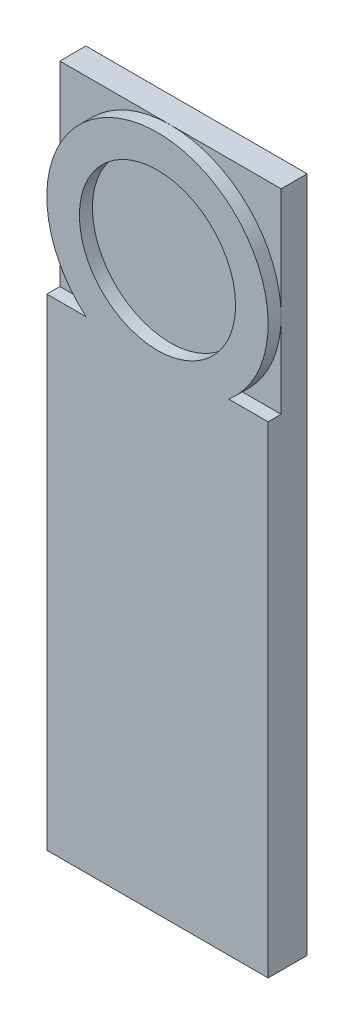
from build123d import *

# Parameters (mm, degrees)
SKETCH1_R           = 17
SKETCH1_R_2         = 12
BOSS_EXTRUDE1_DEPTH = 4
BOSS_EXTRUDE3_START = 4
SKETCH2_R           = 17
SKETCH2_R_2         = 12
BOSS_EXTRUDE3_DEPTH = 4
BOSS_EXTRUDE6_DEPTH = 4
SKETCH5_W           = 34
SKETCH5_H           = 8
BOSS_EXTRUDE7_DEPTH = 70
CUT_EXTRUDE1_START  = -2
SKETCH6_R           = 12
CUT_EXTRUDE1_DEPTH  = 2


with BuildPart() as part:
    # Sketch1 → Boss-Extrude1 (new body)
    with BuildSketch(Plane.XY):
        Circle(SKETCH1_R)
        Circle(SKETCH1_R_2, mode=Mode.SUBTRACT)
    extrude(amount=BOSS_EXTRUDE1_DEPTH)

    # Sketch2 → Boss-Extrude3 (add)
    # profile 1 of 6: a face of its own
    with BuildSketch(Plane(origin=(0, 0, 0), x_dir=(-1, 0, 0), z_dir=(0, 0, -1)).offset(BOSS_EXTRUDE3_START)):
        with BuildLine():
            Line((-5.6e-08, 17), (-17, 17))
            Line((-17, 17), (-17, 0))
            ThreePointArc((-17, 0), (-12.0208153, 12.02081526), (-5.6e-08, 17))
        make_face()
    # profile 2 of 6: a face of its own
    with BuildSketch(Plane(origin=(0, 0, 0), x_dir=(-1, 0, 0), z_dir=(0, 0, -1)).offset(BOSS_EXTRUDE3_START)):
        with BuildLine():
            ThreePointArc((0, -17), (-12.02081528, -12.02081528), (-17, 0))
            Line((-17, 0), (-17, -17))
            Line((-17, -17), (0, -17))
        make_face()
    # profile 3 of 6: a face of its own
    with BuildSketch(Plane(origin=(0, 0, 0), x_dir=(-1, 0, 0), z_dir=(0, 0, -1)).offset(BOSS_EXTRUDE3_START)):
        with BuildLine():
            Line((17, -17), (17, 0))
            ThreePointArc((17, 0), (12.02081528, -12.02081528), (0, -17))
            Line((0, -17), (17, -17))
        make_face()
    # profile 4 of 6: a face of its own
    with BuildSketch(Plane(origin=(0, 0, 0), x_dir=(-1, 0, 0), z_dir=(0, 0, -1)).offset(BOSS_EXTRUDE3_START)):
        with BuildLine():
            Line((17, 17), (-5.6e-08, 17))
            ThreePointArc((-5.6e-08, 17), (12.02081526, 12.0208153), (17, 0))
            Line((17, 0), (17, 17))
        make_face()
    # profile 5 of 6: a face of its own
    with BuildSketch(Plane(origin=(0, 0, 0), x_dir=(-1, 0, 0), z_dir=(0, 0, -1)).offset(BOSS_EXTRUDE3_START)):
        with Locations(Location((0, 0, 0), (0, 0, 180))):
            Circle(SKETCH2_R)
        with Locations(Location((0, 0, 0), (0, 0, 180))):
            Circle(SKETCH2_R_2, mode=Mode.SUBTRACT)
    # profile 6 of 6: a face of its own
    with BuildSketch(Plane(origin=(0, 0, 0), x_dir=(-1, 0, 0), z_dir=(0, 0, -1)).offset(BOSS_EXTRUDE3_START)):
        with Locations(Location((0, 0, 0), (0, 0, 180))):
            Circle(SKETCH2_R_2)
    extrude(amount=-BOSS_EXTRUDE3_DEPTH)

    # Sketch4 → Boss-Extrude6 (add)
    with BuildSketch(Plane.XZ.offset(17)):
        Polygon((-17, 4), (-17, 0), (0, 0), (17, 0), (17, 4), align=None)
    extrude(amount=-BOSS_EXTRUDE6_DEPTH)

    # Sketch5 → Boss-Extrude7 (add)
    with BuildSketch(Plane.XZ.offset(17)):
        Rectangle(SKETCH5_W, SKETCH5_H)
    extrude(amount=BOSS_EXTRUDE7_DEPTH)

    # Sketch6 → Cut-Extrude1 (cut)
    with BuildSketch(Plane.XY.offset(4).offset(CUT_EXTRUDE1_START)):
        with BuildLine():
            Line((-10.95445115, -13), (-17, -13))
            Line((-17, -13), (-17, -87))
            Line((-17, -87), (17, -87))
            Line((17, -87), (17, -13))
            Line((17, -13), (10.95445115, -13))
            ThreePointArc((10.95445115, -13), (0, 17), (-10.95445115, -13))
        make_face()
        Circle(SKETCH6_R, mode=Mode.SUBTRACT)
    extrude(amount=CUT_EXTRUDE1_DEPTH, mode=Mode.SUBTRACT)


solid = part.part
